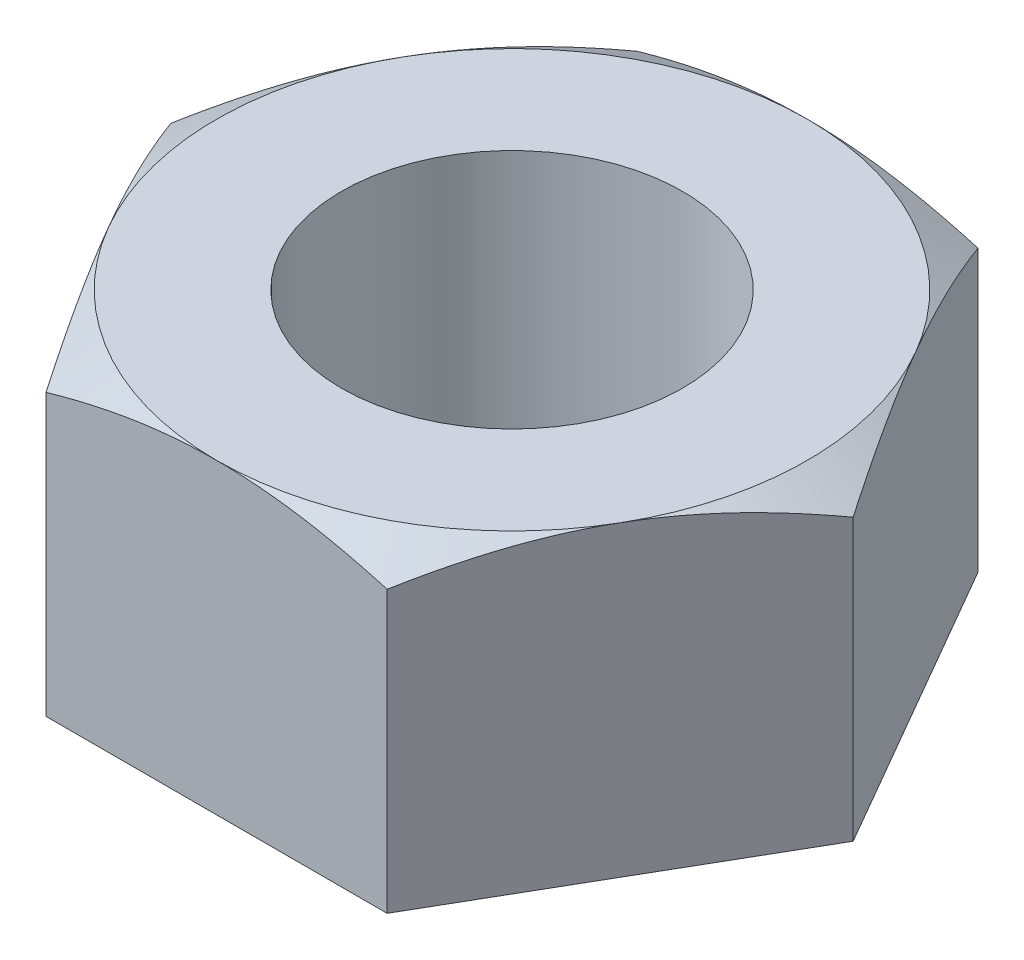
from build123d import *

# Parameters (mm, degrees)
SKETCH1_R      = 5
EXTRUDE1_DEPTH = 9


with BuildPart() as part:
    # Sketch1 → Extrude1 (new body)
    with BuildSketch(Plane(origin=(0, 0, 0), x_dir=(1, 0, 0), z_dir=(0, 1, 0))):
        Polygon((10, 0), (5, 8.660254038), (-5, 8.660254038), (-10, 0), (-5, -8.660254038), (5, -8.660254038), align=None)
        with Locations(Location((0, 0, 0), (0, 0, 270))):
            Circle(SKETCH1_R, mode=Mode.SUBTRACT)
    extrude(amount=EXTRUDE1_DEPTH)

    # Sketch6 → Cut-Revolve6 (revolve, cut)
    with BuildSketch(Plane.XY):
        Polygon((8.660254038, 9), (13.80549957, 9), (12.180398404, 6.967643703), align=None)
    revolve(axis=Axis((0, 9, 0), (0, -1, 0)), mode=Mode.SUBTRACT)


solid = part.part
